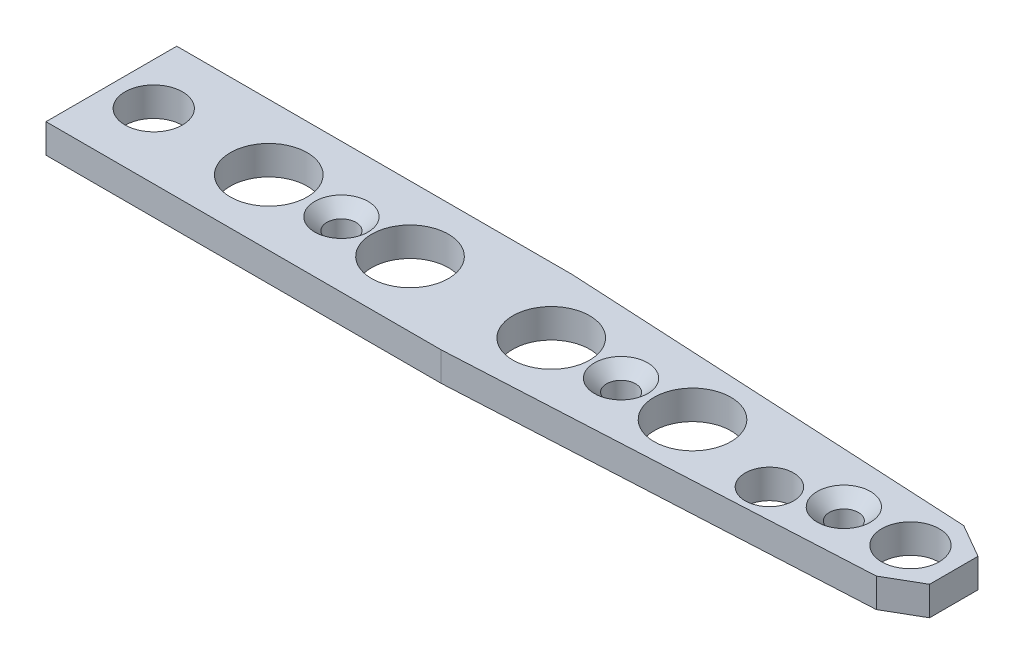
ISO-10303-21;
HEADER;
FILE_DESCRIPTION(('STEP AP214'),'2;1');
FILE_NAME('part.step','',(''),(''),'','','');
FILE_SCHEMA(('AUTOMOTIVE_DESIGN { 1 0 10303 214 1 1 1 1 }'));
ENDSEC;
DATA;
#1=APPLICATION_CONTEXT('core data for automotive mechanical design processes');
#2=APPLICATION_PROTOCOL_DEFINITION('international standard','automotive_design',2000,#1);
#3=PRODUCT_CONTEXT('',#1,'mechanical');
#4=PRODUCT('Part','Part','',(#3));
#5=PRODUCT_RELATED_PRODUCT_CATEGORY('part','',(#4));
#6=PRODUCT_DEFINITION_FORMATION('','',#4);
#7=PRODUCT_DEFINITION_CONTEXT('part definition',#1,'design');
#8=PRODUCT_DEFINITION('design','',#6,#7);
#9=PRODUCT_DEFINITION_SHAPE('','',#8);
#10=(LENGTH_UNIT() NAMED_UNIT(*) SI_UNIT(.MILLI.,.METRE.));
#11=(NAMED_UNIT(*) PLANE_ANGLE_UNIT() SI_UNIT($,.RADIAN.));
#12=(NAMED_UNIT(*) SI_UNIT($,.STERADIAN.) SOLID_ANGLE_UNIT());
#13=UNCERTAINTY_MEASURE_WITH_UNIT(LENGTH_MEASURE(1.E-05),#10,'distance_accuracy_value','');
#14=(GEOMETRIC_REPRESENTATION_CONTEXT(3) GLOBAL_UNCERTAINTY_ASSIGNED_CONTEXT((#13)) GLOBAL_UNIT_ASSIGNED_CONTEXT((#10,
#11,#12)) REPRESENTATION_CONTEXT('',''));
#15=CARTESIAN_POINT('',(0.,0.,0.));
#16=DIRECTION('',(0.,0.,1.));
#17=DIRECTION('',(1.,0.,0.));
#18=AXIS2_PLACEMENT_3D('',#15,#16,#17);
#19=CARTESIAN_POINT('',(66.7909755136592,-72.8131834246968,3.61024403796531));
#20=DIRECTION('',(0.0523359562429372,0.,0.998629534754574));
#21=DIRECTION('',(0.998629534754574,0.,-0.0523359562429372));
#22=AXIS2_PLACEMENT_3D('',#19,#20,#21);
#23=PLANE('',#22);
#24=DIRECTION('',(-0.998629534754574,0.,0.0523359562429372));
#25=VECTOR('',#24,1.);
#26=CARTESIAN_POINT('',(66.7909755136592,-2.4,3.61024403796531));
#27=LINE('',#26,#25);
#28=CARTESIAN_POINT('',(66.7909755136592,-2.4,3.61024403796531));
#29=VERTEX_POINT('',#28);
#30=CARTESIAN_POINT('',(32.6403973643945,-2.4,5.4));
#31=VERTEX_POINT('',#30);
#32=EDGE_CURVE('E57',#29,#31,#27,.T.);
#33=ORIENTED_EDGE('',*,*,#32,.F.);
#34=DIRECTION('',(0.,1.,0.));
#35=VECTOR('',#34,1.);
#36=CARTESIAN_POINT('',(66.7909755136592,-72.8131834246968,3.61024403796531));
#37=LINE('',#36,#35);
#38=CARTESIAN_POINT('',(66.7909755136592,0.,3.61024403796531));
#39=VERTEX_POINT('',#38);
#40=EDGE_CURVE('E130',#29,#39,#37,.T.);
#41=ORIENTED_EDGE('',*,*,#40,.T.);
#42=DIRECTION('',(0.998629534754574,0.,-0.0523359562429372));
#43=VECTOR('',#42,1.);
#44=CARTESIAN_POINT('',(66.7909755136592,0.,3.61024403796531));
#45=LINE('',#44,#43);
#46=CARTESIAN_POINT('',(32.6403973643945,0.,5.4));
#47=VERTEX_POINT('',#46);
#48=EDGE_CURVE('E160',#47,#39,#45,.T.);
#49=ORIENTED_EDGE('',*,*,#48,.F.);
#50=DIRECTION('',(0.,1.,0.));
#51=VECTOR('',#50,1.);
#52=CARTESIAN_POINT('',(32.6403973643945,-72.8131834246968,5.4));
#53=LINE('',#52,#51);
#54=EDGE_CURVE('E117',#31,#47,#53,.T.);
#55=ORIENTED_EDGE('',*,*,#54,.F.);
#56=EDGE_LOOP('',(#33,#41,#49,#55));
#57=FACE_BOUND('',#56,.T.);
#58=ADVANCED_FACE('F50',(#57),#23,.T.);
#59=CARTESIAN_POINT('',(32.6403973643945,-72.8131834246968,5.4));
#60=DIRECTION('',(0.,0.,1.));
#61=DIRECTION('',(1.,0.,0.));
#62=AXIS2_PLACEMENT_3D('',#59,#60,#61);
#63=PLANE('',#62);
#64=DIRECTION('',(-1.,0.,0.));
#65=VECTOR('',#64,1.);
#66=CARTESIAN_POINT('',(32.6403973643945,-2.4,5.4));
#67=LINE('',#66,#65);
#68=CARTESIAN_POINT('',(0.,-2.4,5.4));
#69=VERTEX_POINT('',#68);
#70=EDGE_CURVE('E94',#31,#69,#67,.T.);
#71=ORIENTED_EDGE('',*,*,#70,.F.);
#72=ORIENTED_EDGE('',*,*,#54,.T.);
#73=DIRECTION('',(1.,0.,0.));
#74=VECTOR('',#73,1.);
#75=CARTESIAN_POINT('',(32.6403973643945,0.,5.4));
#76=LINE('',#75,#74);
#77=CARTESIAN_POINT('',(0.,0.,5.4));
#78=VERTEX_POINT('',#77);
#79=EDGE_CURVE('E132',#78,#47,#76,.T.);
#80=ORIENTED_EDGE('',*,*,#79,.F.);
#81=DIRECTION('',(0.,1.,0.));
#82=VECTOR('',#81,1.);
#83=CARTESIAN_POINT('',(0.,-72.8131834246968,5.4));
#84=LINE('',#83,#82);
#85=EDGE_CURVE('E115',#69,#78,#84,.T.);
#86=ORIENTED_EDGE('',*,*,#85,.F.);
#87=EDGE_LOOP('',(#71,#72,#80,#86));
#88=FACE_BOUND('',#87,.T.);
#89=ADVANCED_FACE('F186',(#88),#63,.T.);
#90=CARTESIAN_POINT('',(0.,-72.8131834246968,-5.4));
#91=DIRECTION('',(-1.,0.,0.));
#92=DIRECTION('',(0.,0.,1.));
#93=AXIS2_PLACEMENT_3D('',#90,#91,#92);
#94=PLANE('',#93);
#95=DIRECTION('',(0.,0.,-1.));
#96=VECTOR('',#95,1.);
#97=CARTESIAN_POINT('',(0.,-2.4,-5.4));
#98=LINE('',#97,#96);
#99=CARTESIAN_POINT('',(0.,-2.4,-5.4));
#100=VERTEX_POINT('',#99);
#101=EDGE_CURVE('E90',#69,#100,#98,.T.);
#102=ORIENTED_EDGE('',*,*,#101,.F.);
#103=ORIENTED_EDGE('',*,*,#85,.T.);
#104=DIRECTION('',(0.,0.,1.));
#105=VECTOR('',#104,1.);
#106=CARTESIAN_POINT('',(0.,0.,-5.4));
#107=LINE('',#106,#105);
#108=CARTESIAN_POINT('',(0.,0.,-5.4));
#109=VERTEX_POINT('',#108);
#110=EDGE_CURVE('E113',#109,#78,#107,.T.);
#111=ORIENTED_EDGE('',*,*,#110,.F.);
#112=DIRECTION('',(0.,1.,0.));
#113=VECTOR('',#112,1.);
#114=CARTESIAN_POINT('',(0.,-72.8131834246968,-5.4));
#115=LINE('',#114,#113);
#116=EDGE_CURVE('E106',#100,#109,#115,.T.);
#117=ORIENTED_EDGE('',*,*,#116,.F.);
#118=EDGE_LOOP('',(#102,#103,#111,#117));
#119=FACE_BOUND('',#118,.T.);
#120=ADVANCED_FACE('F111',(#119),#94,.T.);
#121=CARTESIAN_POINT('',(0.,-72.8131834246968,-5.4));
#122=DIRECTION('',(0.,0.,-1.));
#123=DIRECTION('',(-1.,0.,0.));
#124=AXIS2_PLACEMENT_3D('',#121,#122,#123);
#125=PLANE('',#124);
#126=DIRECTION('',(1.,0.,0.));
#127=VECTOR('',#126,1.);
#128=CARTESIAN_POINT('',(0.,-2.4,-5.4));
#129=LINE('',#128,#127);
#130=CARTESIAN_POINT('',(32.6403973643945,-2.4,-5.4));
#131=VERTEX_POINT('',#130);
#132=EDGE_CURVE('E93',#100,#131,#129,.T.);
#133=ORIENTED_EDGE('',*,*,#132,.F.);
#134=ORIENTED_EDGE('',*,*,#116,.T.);
#135=DIRECTION('',(-1.,0.,0.));
#136=VECTOR('',#135,1.);
#137=CARTESIAN_POINT('',(0.,0.,-5.4));
#138=LINE('',#137,#136);
#139=CARTESIAN_POINT('',(32.6403973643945,0.,-5.4));
#140=VERTEX_POINT('',#139);
#141=EDGE_CURVE('E143',#140,#109,#138,.T.);
#142=ORIENTED_EDGE('',*,*,#141,.F.);
#143=DIRECTION('',(0.,1.,0.));
#144=VECTOR('',#143,1.);
#145=CARTESIAN_POINT('',(32.6403973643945,-72.8131834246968,-5.4));
#146=LINE('',#145,#144);
#147=EDGE_CURVE('E109',#131,#140,#146,.T.);
#148=ORIENTED_EDGE('',*,*,#147,.F.);
#149=EDGE_LOOP('',(#133,#134,#142,#148));
#150=FACE_BOUND('',#149,.T.);
#151=ADVANCED_FACE('F103',(#150),#125,.T.);
#152=CARTESIAN_POINT('',(32.6403973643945,-72.8131834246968,-5.4));
#153=DIRECTION('',(0.0523359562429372,0.,-0.998629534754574));
#154=DIRECTION('',(-0.998629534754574,0.,-0.0523359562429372));
#155=AXIS2_PLACEMENT_3D('',#152,#153,#154);
#156=PLANE('',#155);
#157=DIRECTION('',(0.998629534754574,0.,0.0523359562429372));
#158=VECTOR('',#157,1.);
#159=CARTESIAN_POINT('',(32.6403973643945,-2.4,-5.4));
#160=LINE('',#159,#158);
#161=CARTESIAN_POINT('',(66.7909755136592,-2.4,-3.61024403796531));
#162=VERTEX_POINT('',#161);
#163=EDGE_CURVE('E70',#131,#162,#160,.T.);
#164=ORIENTED_EDGE('',*,*,#163,.F.);
#165=ORIENTED_EDGE('',*,*,#147,.T.);
#166=DIRECTION('',(-0.998629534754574,0.,-0.0523359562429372));
#167=VECTOR('',#166,1.);
#168=CARTESIAN_POINT('',(32.6403973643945,0.,-5.4));
#169=LINE('',#168,#167);
#170=CARTESIAN_POINT('',(66.7909755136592,0.,-3.61024403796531));
#171=VERTEX_POINT('',#170);
#172=EDGE_CURVE('E172',#171,#140,#169,.T.);
#173=ORIENTED_EDGE('',*,*,#172,.F.);
#174=DIRECTION('',(0.,1.,0.));
#175=VECTOR('',#174,1.);
#176=CARTESIAN_POINT('',(66.7909755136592,-72.8131834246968,-3.61024403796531));
#177=LINE('',#176,#175);
#178=EDGE_CURVE('E119',#162,#171,#177,.T.);
#179=ORIENTED_EDGE('',*,*,#178,.F.);
#180=EDGE_LOOP('',(#164,#165,#173,#179));
#181=FACE_BOUND('',#180,.T.);
#182=ADVANCED_FACE('F198',(#181),#156,.T.);
#183=CARTESIAN_POINT('',(69.58,-72.8131834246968,-2.));
#184=DIRECTION('',(0.500000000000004,0.,-0.866025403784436));
#185=DIRECTION('',(-0.866025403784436,0.,-0.500000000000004));
#186=AXIS2_PLACEMENT_3D('',#183,#184,#185);
#187=PLANE('',#186);
#188=DIRECTION('',(0.866025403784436,0.,0.500000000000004));
#189=VECTOR('',#188,1.);
#190=CARTESIAN_POINT('',(69.58,-2.4,-2.));
#191=LINE('',#190,#189);
#192=CARTESIAN_POINT('',(69.58,-2.4,-2.));
#193=VERTEX_POINT('',#192);
#194=EDGE_CURVE('E64',#162,#193,#191,.T.);
#195=ORIENTED_EDGE('',*,*,#194,.F.);
#196=ORIENTED_EDGE('',*,*,#178,.T.);
#197=DIRECTION('',(-0.866025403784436,0.,-0.500000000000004));
#198=VECTOR('',#197,1.);
#199=CARTESIAN_POINT('',(69.58,0.,-2.));
#200=LINE('',#199,#198);
#201=CARTESIAN_POINT('',(69.58,0.,-2.));
#202=VERTEX_POINT('',#201);
#203=EDGE_CURVE('E169',#202,#171,#200,.T.);
#204=ORIENTED_EDGE('',*,*,#203,.F.);
#205=DIRECTION('',(0.,1.,0.));
#206=VECTOR('',#205,1.);
#207=CARTESIAN_POINT('',(69.58,-72.8131834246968,-2.));
#208=LINE('',#207,#206);
#209=EDGE_CURVE('E125',#193,#202,#208,.T.);
#210=ORIENTED_EDGE('',*,*,#209,.F.);
#211=EDGE_LOOP('',(#195,#196,#204,#210));
#212=FACE_BOUND('',#211,.T.);
#213=ADVANCED_FACE('F196',(#212),#187,.T.);
#214=CARTESIAN_POINT('',(69.58,-72.8131834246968,-2.));
#215=DIRECTION('',(1.,0.,0.));
#216=DIRECTION('',(0.,0.,-1.));
#217=AXIS2_PLACEMENT_3D('',#214,#215,#216);
#218=PLANE('',#217);
#219=DIRECTION('',(0.,0.,1.));
#220=VECTOR('',#219,1.);
#221=CARTESIAN_POINT('',(69.58,-2.4,-2.));
#222=LINE('',#221,#220);
#223=CARTESIAN_POINT('',(69.58,-2.4,2.));
#224=VERTEX_POINT('',#223);
#225=EDGE_CURVE('E147',#193,#224,#222,.T.);
#226=ORIENTED_EDGE('',*,*,#225,.F.);
#227=ORIENTED_EDGE('',*,*,#209,.T.);
#228=DIRECTION('',(0.,0.,-1.));
#229=VECTOR('',#228,1.);
#230=CARTESIAN_POINT('',(69.58,0.,-2.));
#231=LINE('',#230,#229);
#232=CARTESIAN_POINT('',(69.58,0.,2.));
#233=VERTEX_POINT('',#232);
#234=EDGE_CURVE('E166',#233,#202,#231,.T.);
#235=ORIENTED_EDGE('',*,*,#234,.F.);
#236=DIRECTION('',(0.,1.,0.));
#237=VECTOR('',#236,1.);
#238=CARTESIAN_POINT('',(69.58,-72.8131834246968,2.));
#239=LINE('',#238,#237);
#240=EDGE_CURVE('E128',#224,#233,#239,.T.);
#241=ORIENTED_EDGE('',*,*,#240,.F.);
#242=EDGE_LOOP('',(#226,#227,#235,#241));
#243=FACE_BOUND('',#242,.T.);
#244=ADVANCED_FACE('F194',(#243),#218,.T.);
#245=CARTESIAN_POINT('',(69.58,-72.8131834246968,2.));
#246=DIRECTION('',(0.500000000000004,0.,0.866025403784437));
#247=DIRECTION('',(0.866025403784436,0.,-0.500000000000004));
#248=AXIS2_PLACEMENT_3D('',#245,#246,#247);
#249=PLANE('',#248);
#250=DIRECTION('',(-0.866025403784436,0.,0.500000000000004));
#251=VECTOR('',#250,1.);
#252=CARTESIAN_POINT('',(69.58,-2.4,2.));
#253=LINE('',#252,#251);
#254=EDGE_CURVE('E13',#224,#29,#253,.T.);
#255=ORIENTED_EDGE('',*,*,#254,.F.);
#256=ORIENTED_EDGE('',*,*,#240,.T.);
#257=DIRECTION('',(0.866025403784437,0.,-0.500000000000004));
#258=VECTOR('',#257,1.);
#259=CARTESIAN_POINT('',(69.58,0.,2.));
#260=LINE('',#259,#258);
#261=EDGE_CURVE('E162',#39,#233,#260,.T.);
#262=ORIENTED_EDGE('',*,*,#261,.F.);
#263=ORIENTED_EDGE('',*,*,#40,.F.);
#264=EDGE_LOOP('',(#255,#256,#262,#263));
#265=FACE_BOUND('',#264,.T.);
#266=ADVANCED_FACE('F219',(#265),#249,.T.);
#267=CARTESIAN_POINT('',(0.,0.,0.));
#268=DIRECTION('',(0.,1.,0.));
#269=DIRECTION('',(0.,0.,1.));
#270=AXIS2_PLACEMENT_3D('',#267,#268,#269);
#271=PLANE('',#270);
#272=CARTESIAN_POINT('',(56.,0.,1.65));
#273=DIRECTION('',(0.,1.,0.));
#274=DIRECTION('',(0.,0.,1.));
#275=AXIS2_PLACEMENT_3D('',#272,#273,#274);
#276=CIRCLE('',#275,2.);
#277=CARTESIAN_POINT('',(56.,0.,3.65));
#278=VERTEX_POINT('',#277);
#279=EDGE_CURVE('E283',#278,#278,#276,.T.);
#280=ORIENTED_EDGE('',*,*,#279,.F.);
#281=EDGE_LOOP('',(#280));
#282=FACE_BOUND('',#281,.T.);
#283=CARTESIAN_POINT('',(13.,0.,0.));
#284=DIRECTION('',(0.,1.,0.));
#285=DIRECTION('',(0.,0.,1.));
#286=AXIS2_PLACEMENT_3D('',#283,#284,#285);
#287=CIRCLE('',#286,3.175);
#288=CARTESIAN_POINT('',(13.,0.,3.175));
#289=VERTEX_POINT('',#288);
#290=EDGE_CURVE('E292',#289,#289,#287,.T.);
#291=ORIENTED_EDGE('',*,*,#290,.F.);
#292=EDGE_LOOP('',(#291));
#293=FACE_BOUND('',#292,.T.);
#294=CARTESIAN_POINT('',(24.6666666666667,0.,0.));
#295=DIRECTION('',(0.,1.,0.));
#296=DIRECTION('',(0.,0.,1.));
#297=AXIS2_PLACEMENT_3D('',#294,#295,#296);
#298=CIRCLE('',#297,3.175);
#299=CARTESIAN_POINT('',(24.6666666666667,0.,3.175));
#300=VERTEX_POINT('',#299);
#301=EDGE_CURVE('E298',#300,#300,#298,.T.);
#302=ORIENTED_EDGE('',*,*,#301,.F.);
#303=EDGE_LOOP('',(#302));
#304=FACE_BOUND('',#303,.T.);
#305=CARTESIAN_POINT('',(36.3333333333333,0.,0.));
#306=DIRECTION('',(0.,1.,0.));
#307=DIRECTION('',(0.,0.,1.));
#308=AXIS2_PLACEMENT_3D('',#305,#306,#307);
#309=CIRCLE('',#308,3.175);
#310=CARTESIAN_POINT('',(36.3333333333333,0.,3.175));
#311=VERTEX_POINT('',#310);
#312=EDGE_CURVE('E304',#311,#311,#309,.T.);
#313=ORIENTED_EDGE('',*,*,#312,.F.);
#314=EDGE_LOOP('',(#313));
#315=FACE_BOUND('',#314,.T.);
#316=CARTESIAN_POINT('',(48.,0.,0.));
#317=DIRECTION('',(0.,1.,0.));
#318=DIRECTION('',(0.,0.,1.));
#319=AXIS2_PLACEMENT_3D('',#316,#317,#318);
#320=CIRCLE('',#319,3.175);
#321=CARTESIAN_POINT('',(48.,0.,3.175));
#322=VERTEX_POINT('',#321);
#323=EDGE_CURVE('E285',#322,#322,#320,.T.);
#324=ORIENTED_EDGE('',*,*,#323,.F.);
#325=EDGE_LOOP('',(#324));
#326=FACE_BOUND('',#325,.T.);
#327=CARTESIAN_POINT('',(19.,0.,0.));
#328=DIRECTION('',(0.,1.,0.));
#329=DIRECTION('',(0.,0.,1.));
#330=AXIS2_PLACEMENT_3D('',#327,#328,#329);
#331=CIRCLE('',#330,2.2);
#332=CARTESIAN_POINT('',(19.,0.,2.2));
#333=VERTEX_POINT('',#332);
#334=EDGE_CURVE('E291',#333,#333,#331,.T.);
#335=ORIENTED_EDGE('',*,*,#334,.F.);
#336=EDGE_LOOP('',(#335));
#337=FACE_BOUND('',#336,.T.);
#338=CARTESIAN_POINT('',(42.1,0.,0.));
#339=DIRECTION('',(0.,1.,0.));
#340=DIRECTION('',(0.,0.,1.));
#341=AXIS2_PLACEMENT_3D('',#338,#339,#340);
#342=CIRCLE('',#341,2.2);
#343=CARTESIAN_POINT('',(42.1,0.,2.2));
#344=VERTEX_POINT('',#343);
#345=EDGE_CURVE('E320',#344,#344,#342,.T.);
#346=ORIENTED_EDGE('',*,*,#345,.F.);
#347=EDGE_LOOP('',(#346));
#348=FACE_BOUND('',#347,.T.);
#349=CARTESIAN_POINT('',(60.5,0.,0.));
#350=DIRECTION('',(0.,1.,0.));
#351=DIRECTION('',(0.,0.,1.));
#352=AXIS2_PLACEMENT_3D('',#349,#350,#351);
#353=CIRCLE('',#352,2.2);
#354=CARTESIAN_POINT('',(60.5,0.,2.2));
#355=VERTEX_POINT('',#354);
#356=EDGE_CURVE('E329',#355,#355,#353,.T.);
#357=ORIENTED_EDGE('',*,*,#356,.F.);
#358=EDGE_LOOP('',(#357));
#359=FACE_BOUND('',#358,.T.);
#360=CARTESIAN_POINT('',(3.5,0.,0.));
#361=DIRECTION('',(0.,1.,0.));
#362=DIRECTION('',(0.,0.,1.));
#363=AXIS2_PLACEMENT_3D('',#360,#361,#362);
#364=CIRCLE('',#363,2.375);
#365=CARTESIAN_POINT('',(3.5,0.,2.375));
#366=VERTEX_POINT('',#365);
#367=EDGE_CURVE('E340',#366,#366,#364,.T.);
#368=ORIENTED_EDGE('',*,*,#367,.F.);
#369=EDGE_LOOP('',(#368));
#370=FACE_BOUND('',#369,.T.);
#371=CARTESIAN_POINT('',(66.,0.,0.));
#372=DIRECTION('',(0.,1.,0.));
#373=DIRECTION('',(0.,0.,1.));
#374=AXIS2_PLACEMENT_3D('',#371,#372,#373);
#375=CIRCLE('',#374,2.375);
#376=CARTESIAN_POINT('',(66.,0.,2.375));
#377=VERTEX_POINT('',#376);
#378=EDGE_CURVE('E154',#377,#377,#375,.T.);
#379=ORIENTED_EDGE('',*,*,#378,.F.);
#380=EDGE_LOOP('',(#379));
#381=FACE_BOUND('',#380,.T.);
#382=ORIENTED_EDGE('',*,*,#48,.T.);
#383=ORIENTED_EDGE('',*,*,#261,.T.);
#384=ORIENTED_EDGE('',*,*,#234,.T.);
#385=ORIENTED_EDGE('',*,*,#203,.T.);
#386=ORIENTED_EDGE('',*,*,#172,.T.);
#387=ORIENTED_EDGE('',*,*,#141,.T.);
#388=ORIENTED_EDGE('',*,*,#110,.T.);
#389=ORIENTED_EDGE('',*,*,#79,.T.);
#390=EDGE_LOOP('',(#382,#383,#384,#385,#386,#387,#388,#389));
#391=FACE_BOUND('',#390,.T.);
#392=ADVANCED_FACE('F174',(#282,#293,#304,#315,#326,#337,#348,#359,#370,#381,#391),#271,.T.);
#393=CARTESIAN_POINT('',(0.,-2.4,0.));
#394=DIRECTION('',(0.,1.,0.));
#395=DIRECTION('',(0.,0.,1.));
#396=AXIS2_PLACEMENT_3D('',#393,#394,#395);
#397=PLANE('',#396);
#398=CARTESIAN_POINT('',(56.,-2.4,1.65));
#399=DIRECTION('',(0.,1.,0.));
#400=DIRECTION('',(0.,0.,1.));
#401=AXIS2_PLACEMENT_3D('',#398,#399,#400);
#402=CIRCLE('',#401,2.);
#403=CARTESIAN_POINT('',(56.,-2.4,3.65));
#404=VERTEX_POINT('',#403);
#405=EDGE_CURVE('E280',#404,#404,#402,.T.);
#406=ORIENTED_EDGE('',*,*,#405,.T.);
#407=EDGE_LOOP('',(#406));
#408=FACE_BOUND('',#407,.T.);
#409=CARTESIAN_POINT('',(13.,-2.4,0.));
#410=DIRECTION('',(0.,1.,0.));
#411=DIRECTION('',(0.,0.,1.));
#412=AXIS2_PLACEMENT_3D('',#409,#410,#411);
#413=CIRCLE('',#412,3.175);
#414=CARTESIAN_POINT('',(13.,-2.4,3.175));
#415=VERTEX_POINT('',#414);
#416=EDGE_CURVE('E288',#415,#415,#413,.T.);
#417=ORIENTED_EDGE('',*,*,#416,.T.);
#418=EDGE_LOOP('',(#417));
#419=FACE_BOUND('',#418,.T.);
#420=CARTESIAN_POINT('',(24.6666666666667,-2.4,0.));
#421=DIRECTION('',(0.,1.,0.));
#422=DIRECTION('',(0.,0.,1.));
#423=AXIS2_PLACEMENT_3D('',#420,#421,#422);
#424=CIRCLE('',#423,3.175);
#425=CARTESIAN_POINT('',(24.6666666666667,-2.4,3.175));
#426=VERTEX_POINT('',#425);
#427=EDGE_CURVE('E295',#426,#426,#424,.T.);
#428=ORIENTED_EDGE('',*,*,#427,.T.);
#429=EDGE_LOOP('',(#428));
#430=FACE_BOUND('',#429,.T.);
#431=CARTESIAN_POINT('',(36.3333333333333,-2.4,0.));
#432=DIRECTION('',(0.,1.,0.));
#433=DIRECTION('',(0.,0.,1.));
#434=AXIS2_PLACEMENT_3D('',#431,#432,#433);
#435=CIRCLE('',#434,3.175);
#436=CARTESIAN_POINT('',(36.3333333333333,-2.4,3.175));
#437=VERTEX_POINT('',#436);
#438=EDGE_CURVE('E301',#437,#437,#435,.T.);
#439=ORIENTED_EDGE('',*,*,#438,.T.);
#440=EDGE_LOOP('',(#439));
#441=FACE_BOUND('',#440,.T.);
#442=CARTESIAN_POINT('',(48.,-2.4,0.));
#443=DIRECTION('',(0.,1.,0.));
#444=DIRECTION('',(0.,0.,1.));
#445=AXIS2_PLACEMENT_3D('',#442,#443,#444);
#446=CIRCLE('',#445,3.175);
#447=CARTESIAN_POINT('',(48.,-2.4,3.175));
#448=VERTEX_POINT('',#447);
#449=EDGE_CURVE('E307',#448,#448,#446,.T.);
#450=ORIENTED_EDGE('',*,*,#449,.T.);
#451=EDGE_LOOP('',(#450));
#452=FACE_BOUND('',#451,.T.);
#453=CARTESIAN_POINT('',(19.,-2.4,0.));
#454=DIRECTION('',(0.,1.,0.));
#455=DIRECTION('',(0.,0.,1.));
#456=AXIS2_PLACEMENT_3D('',#453,#454,#455);
#457=CIRCLE('',#456,1.2);
#458=CARTESIAN_POINT('',(19.,-2.4,1.2));
#459=VERTEX_POINT('',#458);
#460=EDGE_CURVE('E317',#459,#459,#457,.T.);
#461=ORIENTED_EDGE('',*,*,#460,.T.);
#462=EDGE_LOOP('',(#461));
#463=FACE_BOUND('',#462,.T.);
#464=CARTESIAN_POINT('',(42.1,-2.4,0.));
#465=DIRECTION('',(0.,1.,0.));
#466=DIRECTION('',(0.,0.,1.));
#467=AXIS2_PLACEMENT_3D('',#464,#465,#466);
#468=CIRCLE('',#467,1.2);
#469=CARTESIAN_POINT('',(42.1,-2.4,1.2));
#470=VERTEX_POINT('',#469);
#471=EDGE_CURVE('E326',#470,#470,#468,.T.);
#472=ORIENTED_EDGE('',*,*,#471,.T.);
#473=EDGE_LOOP('',(#472));
#474=FACE_BOUND('',#473,.T.);
#475=CARTESIAN_POINT('',(60.5,-2.4,0.));
#476=DIRECTION('',(0.,1.,0.));
#477=DIRECTION('',(0.,0.,1.));
#478=AXIS2_PLACEMENT_3D('',#475,#476,#477);
#479=CIRCLE('',#478,1.2);
#480=CARTESIAN_POINT('',(60.5,-2.4,1.2));
#481=VERTEX_POINT('',#480);
#482=EDGE_CURVE('E335',#481,#481,#479,.T.);
#483=ORIENTED_EDGE('',*,*,#482,.T.);
#484=EDGE_LOOP('',(#483));
#485=FACE_BOUND('',#484,.T.);
#486=CARTESIAN_POINT('',(3.5,-2.4,0.));
#487=DIRECTION('',(0.,1.,0.));
#488=DIRECTION('',(0.,0.,1.));
#489=AXIS2_PLACEMENT_3D('',#486,#487,#488);
#490=CIRCLE('',#489,2.375);
#491=CARTESIAN_POINT('',(3.5,-2.4,2.375));
#492=VERTEX_POINT('',#491);
#493=EDGE_CURVE('E163',#492,#492,#490,.T.);
#494=ORIENTED_EDGE('',*,*,#493,.T.);
#495=EDGE_LOOP('',(#494));
#496=FACE_BOUND('',#495,.T.);
#497=CARTESIAN_POINT('',(66.,-2.4,0.));
#498=DIRECTION('',(0.,1.,0.));
#499=DIRECTION('',(0.,0.,1.));
#500=AXIS2_PLACEMENT_3D('',#497,#498,#499);
#501=CIRCLE('',#500,2.375);
#502=CARTESIAN_POINT('',(66.,-2.4,2.375));
#503=VERTEX_POINT('',#502);
#504=EDGE_CURVE('E342',#503,#503,#501,.T.);
#505=ORIENTED_EDGE('',*,*,#504,.T.);
#506=EDGE_LOOP('',(#505));
#507=FACE_BOUND('',#506,.T.);
#508=ORIENTED_EDGE('',*,*,#32,.T.);
#509=ORIENTED_EDGE('',*,*,#70,.T.);
#510=ORIENTED_EDGE('',*,*,#101,.T.);
#511=ORIENTED_EDGE('',*,*,#132,.T.);
#512=ORIENTED_EDGE('',*,*,#163,.T.);
#513=ORIENTED_EDGE('',*,*,#194,.T.);
#514=ORIENTED_EDGE('',*,*,#225,.T.);
#515=ORIENTED_EDGE('',*,*,#254,.T.);
#516=EDGE_LOOP('',(#508,#509,#510,#511,#512,#513,#514,#515));
#517=FACE_BOUND('',#516,.T.);
#518=ADVANCED_FACE('F92',(#408,#419,#430,#441,#452,#463,#474,#485,#496,#507,#517),#397,.F.);
#519=CARTESIAN_POINT('',(66.,-2.4,0.));
#520=DIRECTION('',(0.,1.,0.));
#521=DIRECTION('',(0.,0.,1.));
#522=AXIS2_PLACEMENT_3D('',#519,#520,#521);
#523=CYLINDRICAL_SURFACE('',#522,2.375);
#524=ORIENTED_EDGE('',*,*,#504,.F.);
#525=EDGE_LOOP('',(#524));
#526=FACE_BOUND('',#525,.T.);
#527=ORIENTED_EDGE('',*,*,#378,.T.);
#528=EDGE_LOOP('',(#527));
#529=FACE_BOUND('',#528,.T.);
#530=ADVANCED_FACE('F223',(#526,#529),#523,.F.);
#531=CARTESIAN_POINT('',(3.5,-2.4,0.));
#532=DIRECTION('',(0.,1.,0.));
#533=DIRECTION('',(0.,0.,1.));
#534=AXIS2_PLACEMENT_3D('',#531,#532,#533);
#535=CYLINDRICAL_SURFACE('',#534,2.375);
#536=ORIENTED_EDGE('',*,*,#493,.F.);
#537=EDGE_LOOP('',(#536));
#538=FACE_BOUND('',#537,.T.);
#539=ORIENTED_EDGE('',*,*,#367,.T.);
#540=EDGE_LOOP('',(#539));
#541=FACE_BOUND('',#540,.T.);
#542=ADVANCED_FACE('F227',(#538,#541),#535,.F.);
#543=CARTESIAN_POINT('',(60.5,0.,0.));
#544=DIRECTION('',(0.,1.,0.));
#545=DIRECTION('',(0.,0.,1.));
#546=AXIS2_PLACEMENT_3D('',#543,#544,#545);
#547=CYLINDRICAL_SURFACE('',#546,1.2);
#548=ORIENTED_EDGE('',*,*,#482,.F.);
#549=EDGE_LOOP('',(#548));
#550=FACE_BOUND('',#549,.T.);
#551=CARTESIAN_POINT('',(60.5,-1.,0.));
#552=DIRECTION('',(0.,1.,0.));
#553=DIRECTION('',(0.,0.,1.));
#554=AXIS2_PLACEMENT_3D('',#551,#552,#553);
#555=CIRCLE('',#554,1.2);
#556=CARTESIAN_POINT('',(60.5,-1.,1.2));
#557=VERTEX_POINT('',#556);
#558=EDGE_CURVE('E332',#557,#557,#555,.T.);
#559=ORIENTED_EDGE('',*,*,#558,.T.);
#560=EDGE_LOOP('',(#559));
#561=FACE_BOUND('',#560,.T.);
#562=ADVANCED_FACE('F231',(#550,#561),#547,.F.);
#563=CARTESIAN_POINT('',(60.5,0.,0.));
#564=DIRECTION('',(0.,1.,0.));
#565=DIRECTION('',(0.,0.,1.));
#566=AXIS2_PLACEMENT_3D('',#563,#564,#565);
#567=CONICAL_SURFACE('',#566,2.2,0.785398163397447);
#568=ORIENTED_EDGE('',*,*,#558,.F.);
#569=EDGE_LOOP('',(#568));
#570=FACE_BOUND('',#569,.T.);
#571=ORIENTED_EDGE('',*,*,#356,.T.);
#572=EDGE_LOOP('',(#571));
#573=FACE_BOUND('',#572,.T.);
#574=ADVANCED_FACE('F235',(#570,#573),#567,.F.);
#575=CARTESIAN_POINT('',(42.1,0.,0.));
#576=DIRECTION('',(0.,1.,0.));
#577=DIRECTION('',(0.,0.,1.));
#578=AXIS2_PLACEMENT_3D('',#575,#576,#577);
#579=CYLINDRICAL_SURFACE('',#578,1.2);
#580=ORIENTED_EDGE('',*,*,#471,.F.);
#581=EDGE_LOOP('',(#580));
#582=FACE_BOUND('',#581,.T.);
#583=CARTESIAN_POINT('',(42.1,-1.,0.));
#584=DIRECTION('',(0.,1.,0.));
#585=DIRECTION('',(0.,0.,1.));
#586=AXIS2_PLACEMENT_3D('',#583,#584,#585);
#587=CIRCLE('',#586,1.2);
#588=CARTESIAN_POINT('',(42.1,-1.,1.2));
#589=VERTEX_POINT('',#588);
#590=EDGE_CURVE('E323',#589,#589,#587,.T.);
#591=ORIENTED_EDGE('',*,*,#590,.T.);
#592=EDGE_LOOP('',(#591));
#593=FACE_BOUND('',#592,.T.);
#594=ADVANCED_FACE('F239',(#582,#593),#579,.F.);
#595=CARTESIAN_POINT('',(42.1,0.,0.));
#596=DIRECTION('',(0.,1.,0.));
#597=DIRECTION('',(0.,0.,1.));
#598=AXIS2_PLACEMENT_3D('',#595,#596,#597);
#599=CONICAL_SURFACE('',#598,2.2,0.785398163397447);
#600=ORIENTED_EDGE('',*,*,#590,.F.);
#601=EDGE_LOOP('',(#600));
#602=FACE_BOUND('',#601,.T.);
#603=ORIENTED_EDGE('',*,*,#345,.T.);
#604=EDGE_LOOP('',(#603));
#605=FACE_BOUND('',#604,.T.);
#606=ADVANCED_FACE('F243',(#602,#605),#599,.F.);
#607=CARTESIAN_POINT('',(19.,0.,0.));
#608=DIRECTION('',(0.,1.,0.));
#609=DIRECTION('',(0.,0.,1.));
#610=AXIS2_PLACEMENT_3D('',#607,#608,#609);
#611=CYLINDRICAL_SURFACE('',#610,1.2);
#612=ORIENTED_EDGE('',*,*,#460,.F.);
#613=EDGE_LOOP('',(#612));
#614=FACE_BOUND('',#613,.T.);
#615=CARTESIAN_POINT('',(19.,-1.,0.));
#616=DIRECTION('',(0.,1.,0.));
#617=DIRECTION('',(0.,0.,1.));
#618=AXIS2_PLACEMENT_3D('',#615,#616,#617);
#619=CIRCLE('',#618,1.2);
#620=CARTESIAN_POINT('',(19.,-1.,1.2));
#621=VERTEX_POINT('',#620);
#622=EDGE_CURVE('E314',#621,#621,#619,.T.);
#623=ORIENTED_EDGE('',*,*,#622,.T.);
#624=EDGE_LOOP('',(#623));
#625=FACE_BOUND('',#624,.T.);
#626=ADVANCED_FACE('F247',(#614,#625),#611,.F.);
#627=CARTESIAN_POINT('',(19.,0.,0.));
#628=DIRECTION('',(0.,1.,0.));
#629=DIRECTION('',(0.,0.,1.));
#630=AXIS2_PLACEMENT_3D('',#627,#628,#629);
#631=CONICAL_SURFACE('',#630,2.2,0.785398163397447);
#632=ORIENTED_EDGE('',*,*,#622,.F.);
#633=EDGE_LOOP('',(#632));
#634=FACE_BOUND('',#633,.T.);
#635=ORIENTED_EDGE('',*,*,#334,.T.);
#636=EDGE_LOOP('',(#635));
#637=FACE_BOUND('',#636,.T.);
#638=ADVANCED_FACE('F251',(#634,#637),#631,.F.);
#639=CARTESIAN_POINT('',(48.,-2.4,0.));
#640=DIRECTION('',(0.,1.,0.));
#641=DIRECTION('',(0.,0.,1.));
#642=AXIS2_PLACEMENT_3D('',#639,#640,#641);
#643=CYLINDRICAL_SURFACE('',#642,3.175);
#644=ORIENTED_EDGE('',*,*,#449,.F.);
#645=EDGE_LOOP('',(#644));
#646=FACE_BOUND('',#645,.T.);
#647=ORIENTED_EDGE('',*,*,#323,.T.);
#648=EDGE_LOOP('',(#647));
#649=FACE_BOUND('',#648,.T.);
#650=ADVANCED_FACE('F255',(#646,#649),#643,.F.);
#651=CARTESIAN_POINT('',(36.3333333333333,-2.4,0.));
#652=DIRECTION('',(0.,1.,0.));
#653=DIRECTION('',(0.,0.,1.));
#654=AXIS2_PLACEMENT_3D('',#651,#652,#653);
#655=CYLINDRICAL_SURFACE('',#654,3.175);
#656=ORIENTED_EDGE('',*,*,#438,.F.);
#657=EDGE_LOOP('',(#656));
#658=FACE_BOUND('',#657,.T.);
#659=ORIENTED_EDGE('',*,*,#312,.T.);
#660=EDGE_LOOP('',(#659));
#661=FACE_BOUND('',#660,.T.);
#662=ADVANCED_FACE('F259',(#658,#661),#655,.F.);
#663=CARTESIAN_POINT('',(24.6666666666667,-2.4,0.));
#664=DIRECTION('',(0.,1.,0.));
#665=DIRECTION('',(0.,0.,1.));
#666=AXIS2_PLACEMENT_3D('',#663,#664,#665);
#667=CYLINDRICAL_SURFACE('',#666,3.175);
#668=ORIENTED_EDGE('',*,*,#427,.F.);
#669=EDGE_LOOP('',(#668));
#670=FACE_BOUND('',#669,.T.);
#671=ORIENTED_EDGE('',*,*,#301,.T.);
#672=EDGE_LOOP('',(#671));
#673=FACE_BOUND('',#672,.T.);
#674=ADVANCED_FACE('F263',(#670,#673),#667,.F.);
#675=CARTESIAN_POINT('',(13.,-2.4,0.));
#676=DIRECTION('',(0.,1.,0.));
#677=DIRECTION('',(0.,0.,1.));
#678=AXIS2_PLACEMENT_3D('',#675,#676,#677);
#679=CYLINDRICAL_SURFACE('',#678,3.175);
#680=ORIENTED_EDGE('',*,*,#416,.F.);
#681=EDGE_LOOP('',(#680));
#682=FACE_BOUND('',#681,.T.);
#683=ORIENTED_EDGE('',*,*,#290,.T.);
#684=EDGE_LOOP('',(#683));
#685=FACE_BOUND('',#684,.T.);
#686=ADVANCED_FACE('F267',(#682,#685),#679,.F.);
#687=CARTESIAN_POINT('',(56.,-2.4,1.65));
#688=DIRECTION('',(0.,1.,0.));
#689=DIRECTION('',(0.,0.,1.));
#690=AXIS2_PLACEMENT_3D('',#687,#688,#689);
#691=CYLINDRICAL_SURFACE('',#690,2.);
#692=ORIENTED_EDGE('',*,*,#405,.F.);
#693=EDGE_LOOP('',(#692));
#694=FACE_BOUND('',#693,.T.);
#695=ORIENTED_EDGE('',*,*,#279,.T.);
#696=EDGE_LOOP('',(#695));
#697=FACE_BOUND('',#696,.T.);
#698=ADVANCED_FACE('F271',(#694,#697),#691,.F.);
#699=CLOSED_SHELL('',(#58,#89,#120,#151,#182,#213,#244,#266,#392,#518,#530,#542,#562,#574,#594,
#606,#626,#638,#650,#662,#674,#686,#698));
#700=MANIFOLD_SOLID_BREP('B2',#699);
#701=ADVANCED_BREP_SHAPE_REPRESENTATION('',(#18,#700),#14);
#702=SHAPE_DEFINITION_REPRESENTATION(#9,#701);
ENDSEC;
END-ISO-10303-21;
